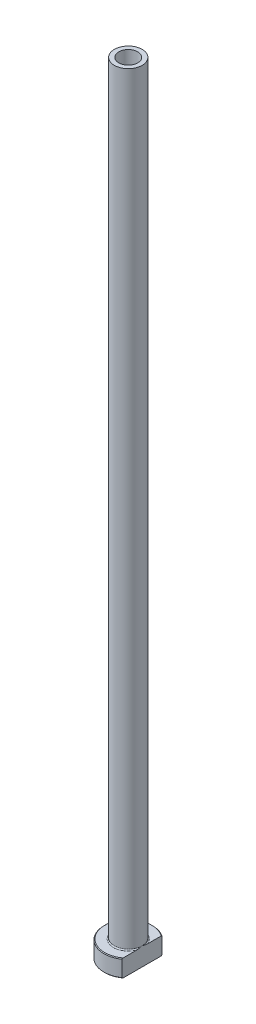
from build123d import *

# Parameters (mm, degrees)
FILLET1_R          = 0.3
CHAMFER1_SIZE      = 0.2
CUT_EXTRUDE1_DEPTH = 226.217672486
CHAMFER2_SIZE      = 0.5


with BuildPart() as part:
    # Sketch1 → Revolve1 (revolve)
    with BuildSketch(Plane.XY, mode=Mode.PRIVATE) as revolve1_sk:
        Polygon((-2.75, 225), (-4, 225), (-4, 5), (-7, 5), (-7, 0), (-3, 0), (-3, 168), (-2.75, 180), align=None)
    revolve(revolve1_sk.sketch.rotate(Axis((0, 92.187680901, 0), (0, -1, 0)), 270), axis=Axis((0, 92.187680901, 0), (0, -1, 0)))

    # Fillet1
    fillet1_edges = [part.edges().sort_by_distance(p)[0] for p in [
        (0, 5, -4),
    ]]
    fillet(fillet1_edges, radius=FILLET1_R)

    # Chamfer1
    chamfer1_edges = [part.edges().sort_by_distance(p)[0] for p in [
        (0, 0, -7),
        (0, 5, -7),
    ]]
    chamfer(chamfer1_edges, length=CHAMFER1_SIZE)

    # Sketch2 → Cut-Extrude1 (cut, through all)
    with BuildSketch(Plane.XZ):
        with BuildLine():
            Line((4, 5.744562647), (4, -5.744562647))
            ThreePointArc((4, -5.744562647), (7, 0), (4, 5.744562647))
        make_face()
    extrude(amount=-CUT_EXTRUDE1_DEPTH, mode=Mode.SUBTRACT)

    # Chamfer2
    chamfer2_edges = [part.edges().sort_by_distance(p)[0] for p in [
        (0, 0, -3),
    ]]
    chamfer(chamfer2_edges, length=CHAMFER2_SIZE)


solid = part.part
